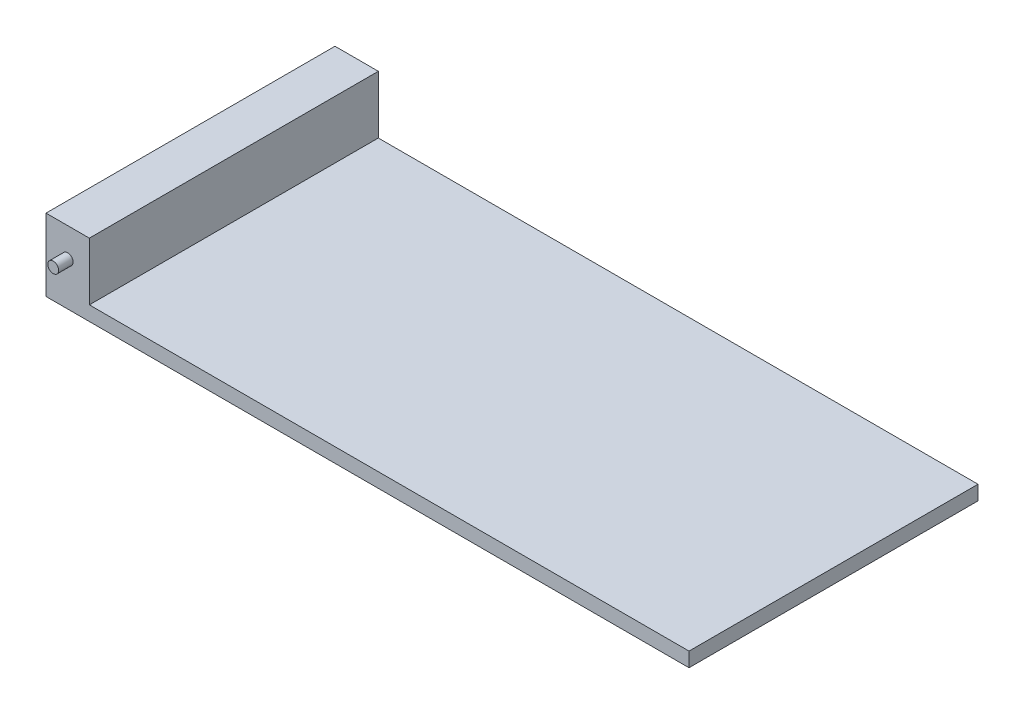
ISO-10303-21;
HEADER;
FILE_DESCRIPTION(('STEP AP214'),'2;1');
FILE_NAME('part.step','',(''),(''),'','','');
FILE_SCHEMA(('AUTOMOTIVE_DESIGN { 1 0 10303 214 1 1 1 1 }'));
ENDSEC;
DATA;
#1=APPLICATION_CONTEXT('core data for automotive mechanical design processes');
#2=APPLICATION_PROTOCOL_DEFINITION('international standard','automotive_design',2000,#1);
#3=PRODUCT_CONTEXT('',#1,'mechanical');
#4=PRODUCT('Part','Part','',(#3));
#5=PRODUCT_RELATED_PRODUCT_CATEGORY('part','',(#4));
#6=PRODUCT_DEFINITION_FORMATION('','',#4);
#7=PRODUCT_DEFINITION_CONTEXT('part definition',#1,'design');
#8=PRODUCT_DEFINITION('design','',#6,#7);
#9=PRODUCT_DEFINITION_SHAPE('','',#8);
#10=(LENGTH_UNIT() NAMED_UNIT(*) SI_UNIT(.MILLI.,.METRE.));
#11=(NAMED_UNIT(*) PLANE_ANGLE_UNIT() SI_UNIT($,.RADIAN.));
#12=(NAMED_UNIT(*) SI_UNIT($,.STERADIAN.) SOLID_ANGLE_UNIT());
#13=UNCERTAINTY_MEASURE_WITH_UNIT(LENGTH_MEASURE(1.E-05),#10,'distance_accuracy_value','');
#14=(GEOMETRIC_REPRESENTATION_CONTEXT(3) GLOBAL_UNCERTAINTY_ASSIGNED_CONTEXT((#13)) GLOBAL_UNIT_ASSIGNED_CONTEXT((#10,
#11,#12)) REPRESENTATION_CONTEXT('',''));
#15=CARTESIAN_POINT('',(0.,0.,0.));
#16=DIRECTION('',(0.,0.,1.));
#17=DIRECTION('',(1.,0.,0.));
#18=AXIS2_PLACEMENT_3D('',#15,#16,#17);
#19=CARTESIAN_POINT('',(0.,12.7,254.));
#20=DIRECTION('',(0.,-1.,0.));
#21=DIRECTION('',(0.,0.,-1.));
#22=AXIS2_PLACEMENT_3D('',#19,#20,#21);
#23=PLANE('',#22);
#24=DIRECTION('',(0.,0.,-1.));
#25=VECTOR('',#24,1.);
#26=CARTESIAN_POINT('',(38.1,12.7,254.));
#27=LINE('',#26,#25);
#28=CARTESIAN_POINT('',(38.1,12.7,254.));
#29=VERTEX_POINT('',#28);
#30=CARTESIAN_POINT('',(38.1,12.7,0.));
#31=VERTEX_POINT('',#30);
#32=EDGE_CURVE('E59',#29,#31,#27,.T.);
#33=ORIENTED_EDGE('',*,*,#32,.F.);
#34=DIRECTION('',(-1.,0.,0.));
#35=VECTOR('',#34,1.);
#36=CARTESIAN_POINT('',(0.,12.7,254.));
#37=LINE('',#36,#35);
#38=CARTESIAN_POINT('',(565.15,12.7,254.));
#39=VERTEX_POINT('',#38);
#40=EDGE_CURVE('E143',#39,#29,#37,.T.);
#41=ORIENTED_EDGE('',*,*,#40,.F.);
#42=DIRECTION('',(0.,0.,-1.));
#43=VECTOR('',#42,1.);
#44=CARTESIAN_POINT('',(565.15,12.7,254.));
#45=LINE('',#44,#43);
#46=CARTESIAN_POINT('',(565.15,12.7,0.));
#47=VERTEX_POINT('',#46);
#48=EDGE_CURVE('E156',#39,#47,#45,.T.);
#49=ORIENTED_EDGE('',*,*,#48,.T.);
#50=DIRECTION('',(-1.,0.,0.));
#51=VECTOR('',#50,1.);
#52=CARTESIAN_POINT('',(0.,12.7,0.));
#53=LINE('',#52,#51);
#54=EDGE_CURVE('E114',#47,#31,#53,.T.);
#55=ORIENTED_EDGE('',*,*,#54,.T.);
#56=EDGE_LOOP('',(#33,#41,#49,#55));
#57=FACE_BOUND('',#56,.T.);
#58=ADVANCED_FACE('F43',(#57),#23,.F.);
#59=CARTESIAN_POINT('',(0.,0.,254.));
#60=DIRECTION('',(1.,0.,0.));
#61=DIRECTION('',(0.,0.,-1.));
#62=AXIS2_PLACEMENT_3D('',#59,#60,#61);
#63=PLANE('',#62);
#64=DIRECTION('',(0.,-1.,0.));
#65=VECTOR('',#64,1.);
#66=CARTESIAN_POINT('',(0.,0.,0.));
#67=LINE('',#66,#65);
#68=CARTESIAN_POINT('',(0.,63.5,0.));
#69=VERTEX_POINT('',#68);
#70=CARTESIAN_POINT('',(0.,0.,0.));
#71=VERTEX_POINT('',#70);
#72=EDGE_CURVE('E149',#69,#71,#67,.T.);
#73=ORIENTED_EDGE('',*,*,#72,.T.);
#74=DIRECTION('',(0.,0.,-1.));
#75=VECTOR('',#74,1.);
#76=CARTESIAN_POINT('',(0.,0.,254.));
#77=LINE('',#76,#75);
#78=CARTESIAN_POINT('',(0.,0.,254.));
#79=VERTEX_POINT('',#78);
#80=EDGE_CURVE('E115',#79,#71,#77,.T.);
#81=ORIENTED_EDGE('',*,*,#80,.F.);
#82=DIRECTION('',(0.,-1.,0.));
#83=VECTOR('',#82,1.);
#84=CARTESIAN_POINT('',(0.,0.,254.));
#85=LINE('',#84,#83);
#86=CARTESIAN_POINT('',(0.,63.5,254.));
#87=VERTEX_POINT('',#86);
#88=EDGE_CURVE('E110',#87,#79,#85,.T.);
#89=ORIENTED_EDGE('',*,*,#88,.F.);
#90=DIRECTION('',(0.,0.,1.));
#91=VECTOR('',#90,1.);
#92=CARTESIAN_POINT('',(0.,63.5,254.));
#93=LINE('',#92,#91);
#94=EDGE_CURVE('E112',#69,#87,#93,.T.);
#95=ORIENTED_EDGE('',*,*,#94,.F.);
#96=EDGE_LOOP('',(#73,#81,#89,#95));
#97=FACE_BOUND('',#96,.T.);
#98=ADVANCED_FACE('F44',(#97),#63,.F.);
#99=CARTESIAN_POINT('',(0.,0.,254.));
#100=DIRECTION('',(0.,1.,0.));
#101=DIRECTION('',(0.,0.,1.));
#102=AXIS2_PLACEMENT_3D('',#99,#100,#101);
#103=PLANE('',#102);
#104=DIRECTION('',(1.,0.,0.));
#105=VECTOR('',#104,1.);
#106=CARTESIAN_POINT('',(0.,0.,0.));
#107=LINE('',#106,#105);
#108=CARTESIAN_POINT('',(565.15,0.,0.));
#109=VERTEX_POINT('',#108);
#110=EDGE_CURVE('E170',#71,#109,#107,.T.);
#111=ORIENTED_EDGE('',*,*,#110,.T.);
#112=DIRECTION('',(0.,0.,-1.));
#113=VECTOR('',#112,1.);
#114=CARTESIAN_POINT('',(565.15,0.,254.));
#115=LINE('',#114,#113);
#116=CARTESIAN_POINT('',(565.15,0.,254.));
#117=VERTEX_POINT('',#116);
#118=EDGE_CURVE('E152',#117,#109,#115,.T.);
#119=ORIENTED_EDGE('',*,*,#118,.F.);
#120=DIRECTION('',(1.,0.,0.));
#121=VECTOR('',#120,1.);
#122=CARTESIAN_POINT('',(0.,0.,254.));
#123=LINE('',#122,#121);
#124=EDGE_CURVE('E90',#79,#117,#123,.T.);
#125=ORIENTED_EDGE('',*,*,#124,.F.);
#126=ORIENTED_EDGE('',*,*,#80,.T.);
#127=EDGE_LOOP('',(#111,#119,#125,#126));
#128=FACE_BOUND('',#127,.T.);
#129=ADVANCED_FACE('F169',(#128),#103,.F.);
#130=CARTESIAN_POINT('',(565.15,0.,254.));
#131=DIRECTION('',(-1.,0.,0.));
#132=DIRECTION('',(0.,0.,1.));
#133=AXIS2_PLACEMENT_3D('',#130,#131,#132);
#134=PLANE('',#133);
#135=DIRECTION('',(0.,1.,0.));
#136=VECTOR('',#135,1.);
#137=CARTESIAN_POINT('',(565.15,0.,0.));
#138=LINE('',#137,#136);
#139=EDGE_CURVE('E81',#109,#47,#138,.T.);
#140=ORIENTED_EDGE('',*,*,#139,.T.);
#141=ORIENTED_EDGE('',*,*,#48,.F.);
#142=DIRECTION('',(0.,1.,0.));
#143=VECTOR('',#142,1.);
#144=CARTESIAN_POINT('',(565.15,0.,254.));
#145=LINE('',#144,#143);
#146=EDGE_CURVE('E67',#117,#39,#145,.T.);
#147=ORIENTED_EDGE('',*,*,#146,.F.);
#148=ORIENTED_EDGE('',*,*,#118,.T.);
#149=EDGE_LOOP('',(#140,#141,#147,#148));
#150=FACE_BOUND('',#149,.T.);
#151=ADVANCED_FACE('F168',(#150),#134,.F.);
#152=CARTESIAN_POINT('',(0.,12.7,254.));
#153=DIRECTION('',(0.,0.,-1.));
#154=DIRECTION('',(-1.,0.,0.));
#155=AXIS2_PLACEMENT_3D('',#152,#153,#154);
#156=PLANE('',#155);
#157=CARTESIAN_POINT('',(19.05,38.1,254.));
#158=DIRECTION('',(0.,0.,-1.));
#159=DIRECTION('',(-1.,0.,0.));
#160=AXIS2_PLACEMENT_3D('',#157,#158,#159);
#161=CIRCLE('',#160,4.7625);
#162=CARTESIAN_POINT('',(14.2875,38.1,254.));
#163=VERTEX_POINT('',#162);
#164=EDGE_CURVE('E51',#163,#163,#161,.F.);
#165=ORIENTED_EDGE('',*,*,#164,.F.);
#166=EDGE_LOOP('',(#165));
#167=FACE_BOUND('',#166,.T.);
#168=ORIENTED_EDGE('',*,*,#88,.T.);
#169=ORIENTED_EDGE('',*,*,#124,.T.);
#170=ORIENTED_EDGE('',*,*,#146,.T.);
#171=ORIENTED_EDGE('',*,*,#40,.T.);
#172=DIRECTION('',(0.,-1.,0.));
#173=VECTOR('',#172,1.);
#174=CARTESIAN_POINT('',(38.1,63.5,254.));
#175=LINE('',#174,#173);
#176=CARTESIAN_POINT('',(38.1,63.5,254.));
#177=VERTEX_POINT('',#176);
#178=EDGE_CURVE('E117',#177,#29,#175,.T.);
#179=ORIENTED_EDGE('',*,*,#178,.F.);
#180=DIRECTION('',(1.,0.,0.));
#181=VECTOR('',#180,1.);
#182=CARTESIAN_POINT('',(0.,63.5,254.));
#183=LINE('',#182,#181);
#184=EDGE_CURVE('E118',#87,#177,#183,.T.);
#185=ORIENTED_EDGE('',*,*,#184,.F.);
#186=EDGE_LOOP('',(#168,#169,#170,#171,#179,#185));
#187=FACE_BOUND('',#186,.T.);
#188=ADVANCED_FACE('F120',(#167,#187),#156,.F.);
#189=CARTESIAN_POINT('',(0.,12.7,0.));
#190=DIRECTION('',(0.,0.,-1.));
#191=DIRECTION('',(-1.,0.,0.));
#192=AXIS2_PLACEMENT_3D('',#189,#190,#191);
#193=PLANE('',#192);
#194=CARTESIAN_POINT('',(19.05,38.1,0.));
#195=DIRECTION('',(0.,0.,-1.));
#196=DIRECTION('',(-1.,0.,0.));
#197=AXIS2_PLACEMENT_3D('',#194,#195,#196);
#198=CIRCLE('',#197,4.7625);
#199=CARTESIAN_POINT('',(14.2875,38.1,0.));
#200=VERTEX_POINT('',#199);
#201=EDGE_CURVE('E11',#200,#200,#198,.T.);
#202=ORIENTED_EDGE('',*,*,#201,.F.);
#203=EDGE_LOOP('',(#202));
#204=FACE_BOUND('',#203,.T.);
#205=ORIENTED_EDGE('',*,*,#72,.F.);
#206=DIRECTION('',(-1.,0.,0.));
#207=VECTOR('',#206,1.);
#208=CARTESIAN_POINT('',(0.,63.5,0.));
#209=LINE('',#208,#207);
#210=CARTESIAN_POINT('',(38.1,63.5,0.));
#211=VERTEX_POINT('',#210);
#212=EDGE_CURVE('E130',#211,#69,#209,.T.);
#213=ORIENTED_EDGE('',*,*,#212,.F.);
#214=DIRECTION('',(0.,-1.,0.));
#215=VECTOR('',#214,1.);
#216=CARTESIAN_POINT('',(38.1,63.5,0.));
#217=LINE('',#216,#215);
#218=EDGE_CURVE('E138',#211,#31,#217,.T.);
#219=ORIENTED_EDGE('',*,*,#218,.T.);
#220=ORIENTED_EDGE('',*,*,#54,.F.);
#221=ORIENTED_EDGE('',*,*,#139,.F.);
#222=ORIENTED_EDGE('',*,*,#110,.F.);
#223=EDGE_LOOP('',(#205,#213,#219,#220,#221,#222));
#224=FACE_BOUND('',#223,.T.);
#225=ADVANCED_FACE('F173',(#204,#224),#193,.T.);
#226=CARTESIAN_POINT('',(38.1,63.5,254.));
#227=DIRECTION('',(-1.,0.,0.));
#228=DIRECTION('',(0.,0.,1.));
#229=AXIS2_PLACEMENT_3D('',#226,#227,#228);
#230=PLANE('',#229);
#231=ORIENTED_EDGE('',*,*,#32,.T.);
#232=ORIENTED_EDGE('',*,*,#218,.F.);
#233=DIRECTION('',(0.,0.,-1.));
#234=VECTOR('',#233,1.);
#235=CARTESIAN_POINT('',(38.1,63.5,254.));
#236=LINE('',#235,#234);
#237=EDGE_CURVE('E124',#177,#211,#236,.T.);
#238=ORIENTED_EDGE('',*,*,#237,.F.);
#239=ORIENTED_EDGE('',*,*,#178,.T.);
#240=EDGE_LOOP('',(#231,#232,#238,#239));
#241=FACE_BOUND('',#240,.T.);
#242=ADVANCED_FACE('F172',(#241),#230,.F.);
#243=CARTESIAN_POINT('',(0.,63.5,0.));
#244=DIRECTION('',(0.,-1.,0.));
#245=DIRECTION('',(0.,0.,-1.));
#246=AXIS2_PLACEMENT_3D('',#243,#244,#245);
#247=PLANE('',#246);
#248=ORIENTED_EDGE('',*,*,#94,.T.);
#249=ORIENTED_EDGE('',*,*,#184,.T.);
#250=ORIENTED_EDGE('',*,*,#237,.T.);
#251=ORIENTED_EDGE('',*,*,#212,.T.);
#252=EDGE_LOOP('',(#248,#249,#250,#251));
#253=FACE_BOUND('',#252,.T.);
#254=ADVANCED_FACE('F123',(#253),#247,.F.);
#255=CARTESIAN_POINT('',(19.05,38.1,266.7));
#256=DIRECTION('',(0.,0.,-1.));
#257=DIRECTION('',(-1.,0.,0.));
#258=AXIS2_PLACEMENT_3D('',#255,#256,#257);
#259=CYLINDRICAL_SURFACE('',#258,4.7625);
#260=CARTESIAN_POINT('',(19.05,38.1,266.7));
#261=DIRECTION('',(0.,0.,1.));
#262=DIRECTION('',(1.,0.,0.));
#263=AXIS2_PLACEMENT_3D('',#260,#261,#262);
#264=CIRCLE('',#263,4.7625);
#265=CARTESIAN_POINT('',(23.8125,38.1,266.7));
#266=VERTEX_POINT('',#265);
#267=EDGE_CURVE('E129',#266,#266,#264,.T.);
#268=ORIENTED_EDGE('',*,*,#267,.F.);
#269=EDGE_LOOP('',(#268));
#270=FACE_BOUND('',#269,.T.);
#271=ORIENTED_EDGE('',*,*,#164,.T.);
#272=EDGE_LOOP('',(#271));
#273=FACE_BOUND('',#272,.T.);
#274=ADVANCED_FACE('F182',(#270,#273),#259,.T.);
#275=CARTESIAN_POINT('',(19.05,38.1,266.7));
#276=DIRECTION('',(0.,0.,1.));
#277=DIRECTION('',(1.,0.,0.));
#278=AXIS2_PLACEMENT_3D('',#275,#276,#277);
#279=PLANE('',#278);
#280=ORIENTED_EDGE('',*,*,#267,.T.);
#281=EDGE_LOOP('',(#280));
#282=FACE_BOUND('',#281,.T.);
#283=ADVANCED_FACE('F249',(#282),#279,.T.);
#284=CARTESIAN_POINT('',(19.05,38.1,-12.7));
#285=DIRECTION('',(0.,0.,1.));
#286=DIRECTION('',(1.,0.,0.));
#287=AXIS2_PLACEMENT_3D('',#284,#285,#286);
#288=CYLINDRICAL_SURFACE('',#287,4.7625);
#289=CARTESIAN_POINT('',(19.05,38.1,-12.7));
#290=DIRECTION('',(0.,0.,1.));
#291=DIRECTION('',(1.,0.,0.));
#292=AXIS2_PLACEMENT_3D('',#289,#290,#291);
#293=CIRCLE('',#292,4.7625);
#294=CARTESIAN_POINT('',(23.8125,38.1,-12.7));
#295=VERTEX_POINT('',#294);
#296=EDGE_CURVE('E285',#295,#295,#293,.T.);
#297=ORIENTED_EDGE('',*,*,#296,.T.);
#298=EDGE_LOOP('',(#297));
#299=FACE_BOUND('',#298,.T.);
#300=ORIENTED_EDGE('',*,*,#201,.T.);
#301=EDGE_LOOP('',(#300));
#302=FACE_BOUND('',#301,.T.);
#303=ADVANCED_FACE('F256',(#299,#302),#288,.T.);
#304=CARTESIAN_POINT('',(19.05,38.1,-12.7));
#305=DIRECTION('',(0.,0.,-1.));
#306=DIRECTION('',(1.,0.,0.));
#307=AXIS2_PLACEMENT_3D('',#304,#305,#306);
#308=PLANE('',#307);
#309=ORIENTED_EDGE('',*,*,#296,.F.);
#310=EDGE_LOOP('',(#309));
#311=FACE_BOUND('',#310,.T.);
#312=ADVANCED_FACE('F270',(#311),#308,.T.);
#313=CLOSED_SHELL('',(#58,#98,#129,#151,#188,#225,#242,#254,#274,#283,#303,#312));
#314=MANIFOLD_SOLID_BREP('B2',#313);
#315=ADVANCED_BREP_SHAPE_REPRESENTATION('',(#18,#314),#14);
#316=SHAPE_DEFINITION_REPRESENTATION(#9,#315);
ENDSEC;
END-ISO-10303-21;
